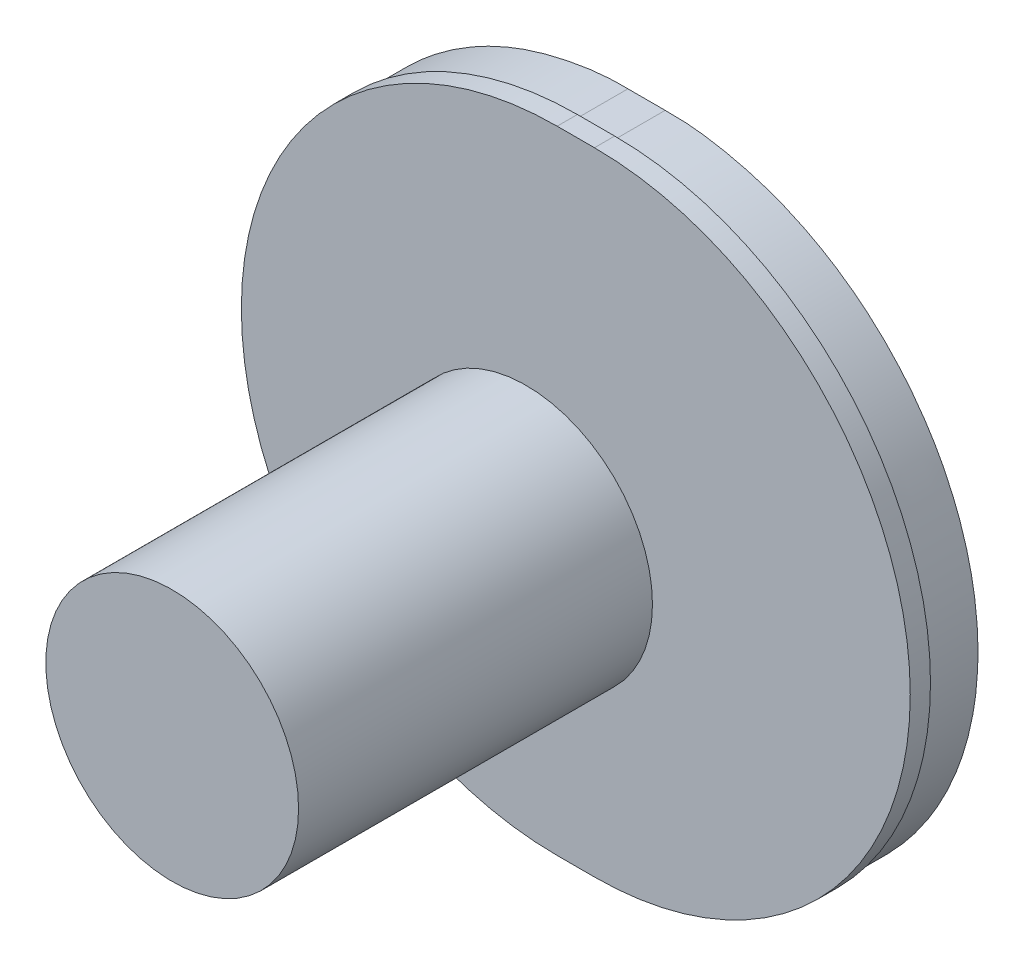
from build123d import *

# Parameters (mm, degrees)
SKETCH2_R           = 12.5
BOSS_EXTRUDE1_DEPTH = 35
SKETCH3_R           = 5
BOSS_EXTRUDE2_DEPTH = 5
BOSS_EXTRUDE3_DEPTH = 2
BOSS_EXTRUDE4_DEPTH = 5
SKETCH5_R           = 3
BOSS_EXTRUDE5_DEPTH = 2


with BuildPart() as part:
    # Sketch2 → Boss-Extrude1 (new body)
    with BuildSketch(Plane.XY.offset(70.459366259)):
        Circle(SKETCH2_R)
    extrude(amount=-BOSS_EXTRUDE1_DEPTH)

    # Sketch3 → Boss-Extrude2 (add)
    with BuildSketch(Plane(origin=(0, 0, 35.459366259), x_dir=(-1, 0, 0), z_dir=(0, 0, -1))):
        Circle(SKETCH3_R)
    extrude(amount=BOSS_EXTRUDE2_DEPTH)

    # Sketch4 → Boss-Extrude3 (add)
    with BuildSketch(Plane(origin=(0, 0, 30.459366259), x_dir=(-1, 0, 0), z_dir=(0, 0, -1))):
        with BuildLine():
            Line((-1.764091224, 31.23281308), (1.926446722, 31.23281308))
            ThreePointArc((1.926446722, 31.23281308), (33.159259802, 0), (1.926446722, -31.23281308))
            Line((1.926446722, -31.23281308), (-1.764091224, -31.23281308))
            ThreePointArc((-1.764091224, -31.23281308), (-32.996904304, 0), (-1.764091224, 31.23281308))
        make_face()
    extrude(amount=BOSS_EXTRUDE3_DEPTH)

    # 3DSketch1 → Boss-Extrude4 (add)
    with BuildSketch(Plane(origin=(-1.926446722, 27.23281308, 28.459366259), x_dir=(0.11654186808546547, -0.9931857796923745, 0), z_dir=(0, 0, -1))):
        with BuildLine():
            Line((-3.674787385, -0.431204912), (-3.245264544, -4.091657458))
            add(Edge.make_bspline(
                [(-3.245264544, -4.091657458), (-3.245148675, -4.09264491), (-3.245032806, -4.093632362), (-3.202912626, -4.452586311), (-3.160800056, -4.811541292), (-3.115913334, -5.170119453), (-2.965070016, -6.240646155), (-2.73973554, -7.301054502), (-2.562142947, -8.003056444), (-2.064081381, -9.744619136), (-1.466679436, -11.449826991), (-1.06939329, -12.4570517), (-0.190966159, -14.434076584), (0.867500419, -16.325003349), (1.439186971, -17.246654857), (2.662353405, -19.037759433), (4.034880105, -20.715317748), (4.756934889, -21.523630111), (6.26953006, -23.075160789), (7.912901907, -24.488182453), (8.765028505, -25.15836034), (10.525656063, -26.422638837), (12.390018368, -27.527940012), (13.345715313, -28.039539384), (15.299304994, -28.978021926), (17.327614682, -29.741844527), (18.357814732, -30.079230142), (20.445035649, -30.6632286), (22.575359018, -31.062238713), (23.648558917, -31.215106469), (25.80556035, -31.426786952), (27.972815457, -31.448796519), (29.056241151, -31.412476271), (31.217158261, -31.245371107), (33.3551457, -30.8897074), (34.415700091, -30.665308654), (36.51451639, -30.124522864), (38.557920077, -29.402051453), (39.563204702, -28.996429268), (41.535811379, -28.098481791), (43.422236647, -27.031267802), (44.341552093, -26.45681118), (46.127684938, -25.229132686), (47.799414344, -23.849791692), (48.604644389, -23.124054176), (50.149767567, -21.604142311), (51.556081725, -19.954751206), (52.222755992, -19.099880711), (53.479577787, -17.334179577), (54.576223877, -15.465337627), (55.083503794, -14.507526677), (56.013978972, -12.549915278), (56.772288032, -10.517905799), (57.106445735, -9.486118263), (57.676268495, -7.413302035), (58.053574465, -5.300534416), (58.196921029, -4.244786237), (58.368244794, -2.481095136), (58.438429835, -0.706484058), (58.445163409, 0), (58.41593185, 1.048801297), (58.316843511, 2.090687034), (58.27935168, 2.431769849), (58.239357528, 2.772603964), (58.199363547, 3.113438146), (58.199360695, 3.113462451)],
                knots=[0, 0, 0, 0, 0, 0, 5.1217e-05, 5.1217e-05, 0.018618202, 0.018618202, 0.018618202, 0.05575217, 0.05575217, 0.05575217, 0.111453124, 0.111453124, 0.111453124, 0.167154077, 0.167154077, 0.167154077, 0.22285503, 0.22285503, 0.22285503, 0.278555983, 0.278555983, 0.278555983, 0.334256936, 0.334256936, 0.334256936, 0.38995789, 0.38995789, 0.38995789, 0.445658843, 0.445658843, 0.445658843, 0.501359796, 0.501359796, 0.501359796, 0.557060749, 0.557060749, 0.557060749, 0.612761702, 0.612761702, 0.612761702, 0.668462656, 0.668462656, 0.668462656, 0.724163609, 0.724163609, 0.724163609, 0.779864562, 0.779864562, 0.779864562, 0.835565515, 0.835565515, 0.835565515, 0.891266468, 0.891266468, 0.891266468, 0.946077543, 0.946077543, 0.946077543, 0.982321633, 0.982321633, 0.982321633, 0.999998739, 1, 1, 1, 1, 1, 1], degree=5))
            Line((58.199360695, 3.113462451), (57.769272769, 6.778730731))
            add(Edge.make_bspline(
                [(57.769272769, 6.778730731), (57.727268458, 7.136697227), (57.685264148, 7.494663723), (57.640500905, 7.852255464), (57.489657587, 8.922782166), (57.26432311, 9.983190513), (57.086730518, 10.685192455), (56.588668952, 12.426755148), (55.991267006, 14.131963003), (55.593980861, 15.139187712), (54.715553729, 17.116212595), (53.657087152, 19.007139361), (53.0854006, 19.928790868), (51.862234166, 21.719895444), (50.489707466, 23.397453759), (49.767652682, 24.205766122), (48.25505751, 25.7572968), (46.611685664, 27.170318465), (45.759559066, 27.840496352), (43.998931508, 29.104774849), (42.134569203, 30.210076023), (41.178872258, 30.721675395), (39.225282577, 31.660157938), (37.196972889, 32.423980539), (36.166772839, 32.761366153), (34.079551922, 33.345364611), (31.949228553, 33.744374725), (30.876028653, 33.897242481), (28.719027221, 34.108922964), (26.551772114, 34.13093253), (25.46834642, 34.094612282), (23.30742931, 33.927507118), (21.169441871, 33.571843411), (20.10888748, 33.347444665), (18.010071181, 32.806658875), (15.966667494, 32.084187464), (14.961382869, 31.678565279), (12.988776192, 30.780617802), (11.102350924, 29.713403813), (10.183035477, 29.138947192), (8.396902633, 27.911268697), (6.725173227, 26.531927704), (5.919943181, 25.806190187), (4.374820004, 24.286278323), (2.968505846, 22.636887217), (2.301831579, 21.782016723), (1.045009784, 20.016315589), (-0.051636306, 18.147473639), (-0.558916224, 17.189662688), (-1.489391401, 15.23205129), (-2.247700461, 13.20004181), (-2.581858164, 12.168254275), (-3.151680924, 10.095438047), (-3.528986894, 7.982670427), (-3.672333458, 6.926922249), (-3.843657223, 5.163231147), (-3.913842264, 3.38862007), (-3.920575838, 2.682136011), (-3.891344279, 1.633334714), (-3.792258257, 0.591473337), (-3.754769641, 0.25041484), (-3.714778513, -0.090395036), (-3.674787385, -0.431204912)],
                knots=[0, 0, 0, 0, 0, 0, 0.018567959, 0.018567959, 0.018567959, 0.055703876, 0.055703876, 0.055703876, 0.111407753, 0.111407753, 0.111407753, 0.167111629, 0.167111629, 0.167111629, 0.222815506, 0.222815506, 0.222815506, 0.278519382, 0.278519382, 0.278519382, 0.334223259, 0.334223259, 0.334223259, 0.389927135, 0.389927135, 0.389927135, 0.445631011, 0.445631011, 0.445631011, 0.501334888, 0.501334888, 0.501334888, 0.557038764, 0.557038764, 0.557038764, 0.612742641, 0.612742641, 0.612742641, 0.668446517, 0.668446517, 0.668446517, 0.724150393, 0.724150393, 0.724150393, 0.77985427, 0.77985427, 0.77985427, 0.835558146, 0.835558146, 0.835558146, 0.891262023, 0.891262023, 0.891262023, 0.946075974, 0.946075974, 0.946075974, 0.982321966, 0.982321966, 0.982321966, 1, 1, 1, 1, 1, 1], degree=5))
        make_face()
        with BuildLine():
            Line((0, 0), (0.430102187, -3.665389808))
            add(Edge.make_bspline(
                [(0.430102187, -3.665389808), (0.46708219, -3.98053847), (0.504062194, -4.295687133), (0.543471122, -4.610505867), (0.676271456, -5.552982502), (0.874652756, -6.486551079), (1.031002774, -7.104583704), (1.469489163, -8.637830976), (1.995433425, -10.139071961), (2.345198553, -11.025818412), (3.118553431, -12.766363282), (4.050412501, -14.431108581), (4.553717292, -15.242517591), (5.630575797, -16.819380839), (6.838928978, -18.296279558), (7.474615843, -19.007906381), (8.806283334, -20.373852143), (10.253084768, -21.617856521), (11.003285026, -22.207871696), (12.553316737, -23.320924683), (14.194675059, -24.294016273), (15.036057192, -24.744421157), (16.75597004, -25.570647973), (18.541665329, -26.243106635), (19.448638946, -26.54013618), (21.286198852, -27.054280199), (23.16170555, -27.405563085), (24.10653563, -27.540145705), (26.00552932, -27.726506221), (27.9135502, -27.745883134), (28.867382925, -27.713907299), (30.769823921, -27.566790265), (32.652077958, -27.253668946), (33.58577511, -27.056111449), (35.433543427, -26.580011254), (37.232527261, -25.943957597), (38.117565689, -25.586853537), (39.854220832, -24.796313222), (41.515003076, -23.856753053), (42.324355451, -23.351009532), (43.896841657, -22.270178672), (45.368608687, -21.055826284), (46.077521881, -20.416897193), (47.43782657, -19.078788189), (48.675925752, -17.626687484), (49.26285639, -16.874071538), (50.369344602, -15.319573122), (51.334816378, -13.674270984), (51.781418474, -12.831027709), (52.600595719, -11.107574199), (53.268200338, -9.318621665), (53.562388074, -8.410250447), (54.064052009, -6.585372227), (54.396226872, -4.725321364), (54.522427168, -3.795855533), (54.673258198, -2.243126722), (54.735048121, -0.680784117), (54.740976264, -0.058805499), (54.715241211, 0.864544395), (54.628007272, 1.781784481), (54.595002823, 2.082047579), (54.559795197, 2.382091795), (54.524587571, 2.682136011)],
                knots=[0, 0, 0, 0, 0, 0, 0.018567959, 0.018567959, 0.018567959, 0.055703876, 0.055703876, 0.055703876, 0.111407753, 0.111407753, 0.111407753, 0.167111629, 0.167111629, 0.167111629, 0.222815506, 0.222815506, 0.222815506, 0.278519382, 0.278519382, 0.278519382, 0.334223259, 0.334223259, 0.334223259, 0.389927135, 0.389927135, 0.389927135, 0.445631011, 0.445631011, 0.445631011, 0.501334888, 0.501334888, 0.501334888, 0.557038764, 0.557038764, 0.557038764, 0.612742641, 0.612742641, 0.612742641, 0.668446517, 0.668446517, 0.668446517, 0.724150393, 0.724150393, 0.724150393, 0.77985427, 0.77985427, 0.77985427, 0.835558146, 0.835558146, 0.835558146, 0.891262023, 0.891262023, 0.891262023, 0.946075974, 0.946075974, 0.946075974, 0.982321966, 0.982321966, 0.982321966, 1, 1, 1, 1, 1, 1], degree=5))
            Line((54.524587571, 2.682136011), (54.094485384, 6.347525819))
            add(Edge.make_bspline(
                [(54.094485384, 6.347525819), (54.057505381, 6.662674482), (54.020525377, 6.977823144), (53.981116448, 7.292641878), (53.848316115, 8.235118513), (53.649934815, 9.16868709), (53.493584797, 9.786719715), (53.055098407, 11.319966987), (52.529154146, 12.821207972), (52.179389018, 13.707954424), (51.40603414, 15.448499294), (50.474175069, 17.113244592), (49.970870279, 17.924653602), (48.894011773, 19.50151685), (47.685658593, 20.97841557), (47.049971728, 21.690042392), (45.718304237, 23.055988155), (44.271502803, 24.299992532), (43.521302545, 24.890007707), (41.971270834, 26.003060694), (40.329912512, 26.976152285), (39.488530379, 27.426557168), (37.768617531, 28.252783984), (35.982922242, 28.925242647), (35.075948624, 29.222272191), (33.238388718, 29.73641621), (31.362882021, 30.087699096), (30.41805194, 30.222281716), (28.519058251, 30.408642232), (26.611037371, 30.428019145), (25.657204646, 30.39604331), (23.75476365, 30.248926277), (21.872509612, 29.935804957), (20.93881246, 29.738247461), (19.091044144, 29.262147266), (17.29206031, 28.626093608), (16.407021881, 28.268989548), (14.670366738, 27.478449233), (13.009584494, 26.538889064), (12.20023212, 26.033145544), (10.627745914, 24.952314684), (9.155978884, 23.737962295), (8.44706569, 23.099033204), (7.086761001, 21.7609242), (5.848661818, 20.308823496), (5.261731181, 19.556207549), (4.155242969, 18.001709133), (3.189771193, 16.356406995), (2.743169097, 15.513163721), (1.923991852, 13.78971021), (1.256387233, 12.000757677), (0.962199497, 11.092386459), (0.460535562, 9.267508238), (0.128360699, 7.407457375), (0.002160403, 6.477991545), (-0.148670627, 4.925262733), (-0.21046055, 3.362920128), (-0.216388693, 2.740941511), (-0.19065364, 1.817591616), (-0.103419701, 0.90035153), (-0.070415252, 0.600088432), (-0.035207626, 0.300044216), (0, 0)],
                knots=[0, 0, 0, 0, 0, 0, 0.018567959, 0.018567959, 0.018567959, 0.055703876, 0.055703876, 0.055703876, 0.111407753, 0.111407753, 0.111407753, 0.167111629, 0.167111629, 0.167111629, 0.222815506, 0.222815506, 0.222815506, 0.278519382, 0.278519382, 0.278519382, 0.334223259, 0.334223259, 0.334223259, 0.389927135, 0.389927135, 0.389927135, 0.445631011, 0.445631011, 0.445631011, 0.501334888, 0.501334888, 0.501334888, 0.557038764, 0.557038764, 0.557038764, 0.612742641, 0.612742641, 0.612742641, 0.668446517, 0.668446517, 0.668446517, 0.724150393, 0.724150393, 0.724150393, 0.77985427, 0.77985427, 0.77985427, 0.835558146, 0.835558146, 0.835558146, 0.891262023, 0.891262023, 0.891262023, 0.946075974, 0.946075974, 0.946075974, 0.982321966, 0.982321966, 0.982321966, 1, 1, 1, 1, 1, 1], degree=5))
        make_face(mode=Mode.SUBTRACT)
    extrude(amount=BOSS_EXTRUDE4_DEPTH)

    # Sketch5 → Boss-Extrude5 (add)
    with BuildSketch(Plane(origin=(0, 0, 28.459366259), x_dir=(-1, 0, 0), z_dir=(0, 0, -1))):
        Circle(SKETCH5_R)
    extrude(amount=BOSS_EXTRUDE5_DEPTH)


solid = part.part
